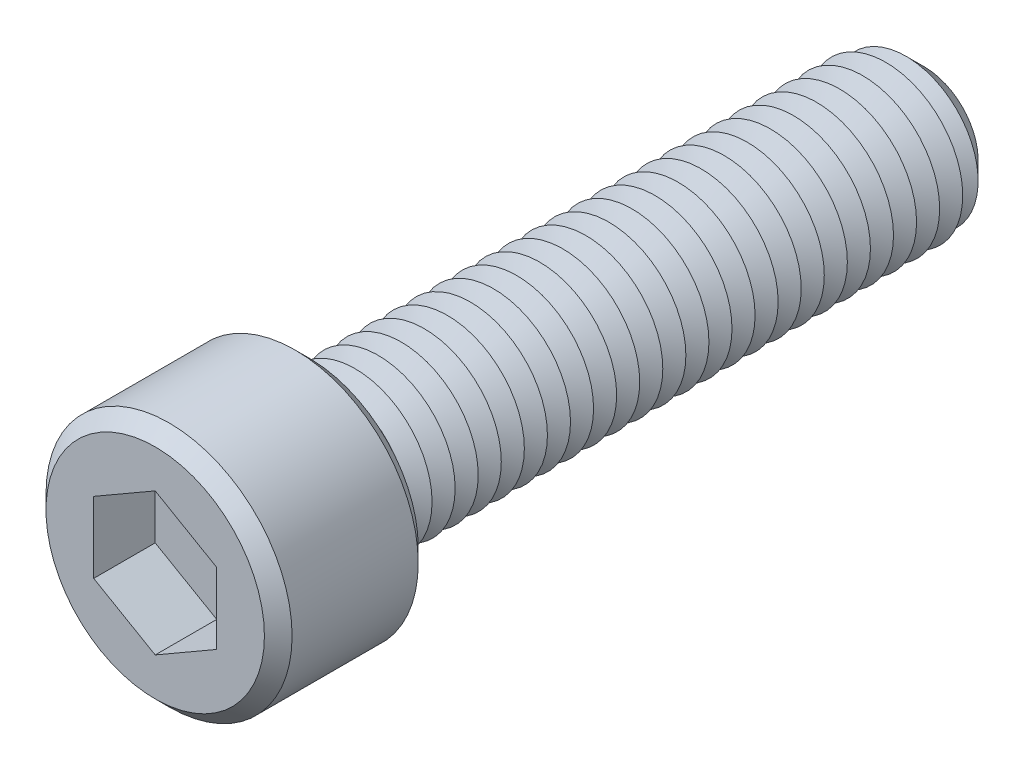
from build123d import *

# Parameters (mm, degrees)
SKETCH1_R           = 8
BOSS_EXTRUDE1_DEPTH = 10
SKETCH2_R           = 5
BOSS_EXTRUDE2_DEPTH = 40
CHAMFER1_SIZE       = 1.5
LPATTERN1_COUNT     = 26
LPATTERN1_PITCH     = 1.5
CUT_EXTRUDE1_DEPTH  = 4
SKETCH6_R           = 0.9
CUT_EXTRUDE2_DEPTH  = 46
CHAMFER2_SIZE       = 0.9


with BuildPart() as part:
    # Sketch1 → Boss-Extrude1 (new body)
    with BuildSketch(Plane.XY):
        Circle(SKETCH1_R)
    extrude(amount=BOSS_EXTRUDE1_DEPTH)

    # Sketch2 → Boss-Extrude2 (add)
    with BuildSketch(Plane(origin=(0, 0, 0), x_dir=(-1, 0, 0), z_dir=(0, 0, -1))):
        Circle(SKETCH2_R)
    extrude(amount=BOSS_EXTRUDE2_DEPTH)

    # Chamfer1
    chamfer1_edges = [part.edges().sort_by_distance(p)[0] for p in [
        (5, 0, -40),
    ]]
    chamfer(chamfer1_edges, length=CHAMFER1_SIZE)

    # Sketch4 → Cut-Revolve1 (revolve, cut)
    with BuildSketch(Plane(origin=(0, 0, 0), x_dir=(0, 0, -1), z_dir=(1, 0, 0)), mode=Mode.PRIVATE) as cut_revolve1_sk:
        Polygon((0, 5), (0.75, 3.700961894), (1.5, 5), align=None)
    cut_revolve1 = revolve(cut_revolve1_sk.sketch.rotate(Axis((0, 0, 2.512122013), (0, 0, -1)), 90), axis=Axis((0, 0, 2.512122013), (0, 0, -1)), mode=Mode.SUBTRACT)

    # LPattern1: Cut-Revolve1 ×26
    with Locations(*[(0, 0, -i * LPATTERN1_PITCH) for i in range(1, LPATTERN1_COUNT)]):
        add(cut_revolve1, mode=Mode.SUBTRACT)

    # Sketch5 → Cut-Extrude1 (cut)
    with BuildSketch(Plane.XY.offset(10)):
        Polygon((0, 4.618802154), (-4, 2.309401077), (-4, -2.309401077), (0, -4.618802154), (4, -2.309401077), (4, 2.309401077), align=None)
    extrude(amount=-CUT_EXTRUDE1_DEPTH, mode=Mode.SUBTRACT)

    # Sketch6 → Cut-Extrude2 (cut)
    with BuildSketch(Plane.XY.offset(6)):
        Circle(SKETCH6_R)
    extrude(amount=-CUT_EXTRUDE2_DEPTH, mode=Mode.SUBTRACT)

    # Chamfer2
    chamfer2_edges = [part.edges().sort_by_distance(p)[0] for p in [
        (-8, 0, 0),
        (-8, 0, 10),
    ]]
    chamfer(chamfer2_edges, length=CHAMFER2_SIZE)


solid = part.part
